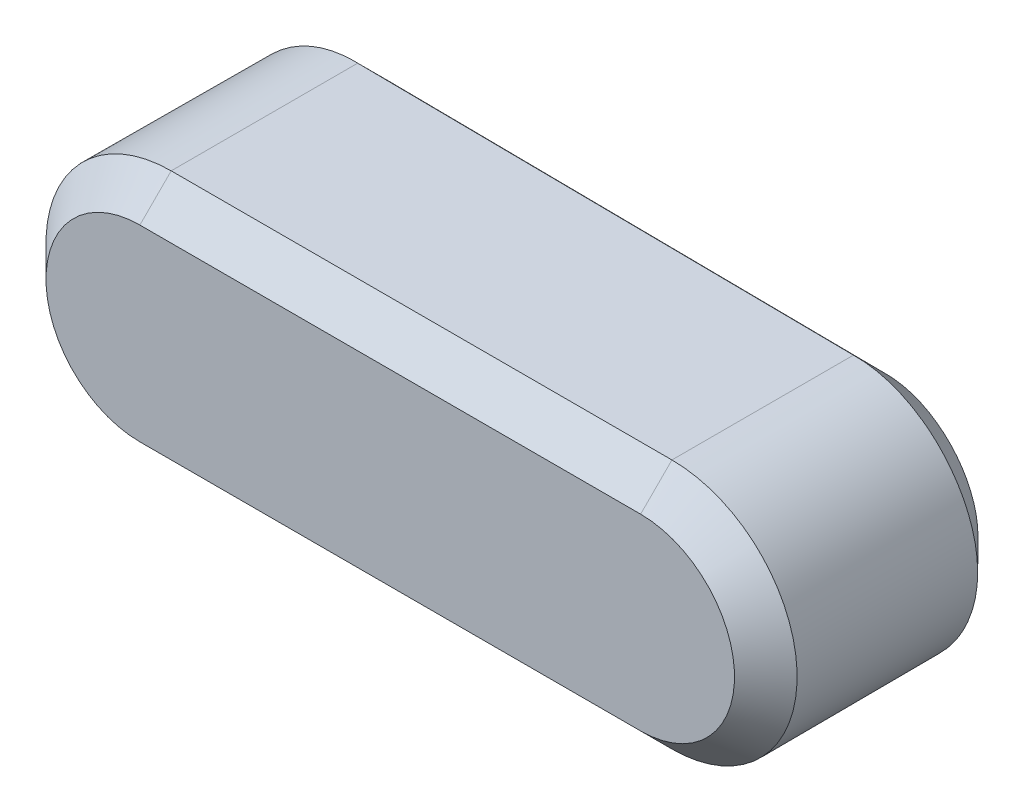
ISO-10303-21;
HEADER;
FILE_DESCRIPTION(('STEP AP214'),'2;1');
FILE_NAME('part.step','',(''),(''),'','','');
FILE_SCHEMA(('AUTOMOTIVE_DESIGN { 1 0 10303 214 1 1 1 1 }'));
ENDSEC;
DATA;
#1=APPLICATION_CONTEXT('core data for automotive mechanical design processes');
#2=APPLICATION_PROTOCOL_DEFINITION('international standard','automotive_design',2000,#1);
#3=PRODUCT_CONTEXT('',#1,'mechanical');
#4=PRODUCT('Part','Part','',(#3));
#5=PRODUCT_RELATED_PRODUCT_CATEGORY('part','',(#4));
#6=PRODUCT_DEFINITION_FORMATION('','',#4);
#7=PRODUCT_DEFINITION_CONTEXT('part definition',#1,'design');
#8=PRODUCT_DEFINITION('design','',#6,#7);
#9=PRODUCT_DEFINITION_SHAPE('','',#8);
#10=(LENGTH_UNIT() NAMED_UNIT(*) SI_UNIT(.MILLI.,.METRE.));
#11=(NAMED_UNIT(*) PLANE_ANGLE_UNIT() SI_UNIT($,.RADIAN.));
#12=(NAMED_UNIT(*) SI_UNIT($,.STERADIAN.) SOLID_ANGLE_UNIT());
#13=UNCERTAINTY_MEASURE_WITH_UNIT(LENGTH_MEASURE(1.E-05),#10,'distance_accuracy_value','');
#14=(GEOMETRIC_REPRESENTATION_CONTEXT(3) GLOBAL_UNCERTAINTY_ASSIGNED_CONTEXT((#13)) GLOBAL_UNIT_ASSIGNED_CONTEXT((#10,
#11,#12)) REPRESENTATION_CONTEXT('',''));
#15=CARTESIAN_POINT('',(0.,0.,0.));
#16=DIRECTION('',(0.,0.,1.));
#17=DIRECTION('',(1.,0.,0.));
#18=AXIS2_PLACEMENT_3D('',#15,#16,#17);
#19=CARTESIAN_POINT('',(-4.,0.,1.));
#20=DIRECTION('',(0.,0.,-1.));
#21=DIRECTION('',(-1.,0.,0.));
#22=AXIS2_PLACEMENT_3D('',#19,#20,#21);
#23=CYLINDRICAL_SURFACE('',#22,0.999999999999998);
#24=DIRECTION('',(0.,0.,-1.));
#25=VECTOR('',#24,1.);
#26=CARTESIAN_POINT('',(-4.,1.,1.));
#27=LINE('',#26,#25);
#28=CARTESIAN_POINT('',(-4.,1.,0.749999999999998));
#29=VERTEX_POINT('',#28);
#30=CARTESIAN_POINT('',(-4.,1.,-0.739987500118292));
#31=VERTEX_POINT('',#30);
#32=EDGE_CURVE('E146',#29,#31,#27,.T.);
#33=ORIENTED_EDGE('',*,*,#32,.T.);
#34=CARTESIAN_POINT('',(-4.,-0.999999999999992,-0.739987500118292));
#35=CARTESIAN_POINT('',(-4.53434581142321,-1.01380328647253,-0.743995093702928));
#36=CARTESIAN_POINT('',(-5.,-0.534524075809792,-0.74748750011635));
#37=CARTESIAN_POINT('',(-5.,0.5345240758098,-0.747487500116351));
#38=CARTESIAN_POINT('',(-4.53434581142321,1.01380328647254,-0.743995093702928));
#39=CARTESIAN_POINT('',(-4.,1.,-0.739987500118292));
#40=B_SPLINE_CURVE_WITH_KNOTS('',3,(#34,#35,#36,#37,#38,#39),.UNSPECIFIED.,.F.,.F.,(4,2,4),
(4.71238898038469,6.28318530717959,7.85398163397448),.UNSPECIFIED.);
#41=CARTESIAN_POINT('',(-4.,-0.999999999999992,-0.739987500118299));
#42=VERTEX_POINT('',#41);
#43=EDGE_CURVE('E114',#31,#42,#40,.F.);
#44=ORIENTED_EDGE('',*,*,#43,.T.);
#45=DIRECTION('',(0.,0.,-1.));
#46=VECTOR('',#45,1.);
#47=CARTESIAN_POINT('',(-4.,-0.999999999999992,1.));
#48=LINE('',#47,#46);
#49=CARTESIAN_POINT('',(-4.,-0.999999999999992,0.749999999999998));
#50=VERTEX_POINT('',#49);
#51=EDGE_CURVE('E122',#50,#42,#48,.T.);
#52=ORIENTED_EDGE('',*,*,#51,.F.);
#53=CARTESIAN_POINT('',(-4.,0.,0.749999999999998));
#54=DIRECTION('',(0.,0.,-1.));
#55=DIRECTION('',(-1.,0.,0.));
#56=AXIS2_PLACEMENT_3D('',#53,#54,#55);
#57=CIRCLE('',#56,0.999999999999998);
#58=EDGE_CURVE('E107',#50,#29,#57,.T.);
#59=ORIENTED_EDGE('',*,*,#58,.T.);
#60=EDGE_LOOP('',(#33,#44,#52,#59));
#61=FACE_BOUND('',#60,.T.);
#62=ADVANCED_FACE('F32',(#61),#23,.T.);
#63=CARTESIAN_POINT('',(0.,-0.999999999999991,1.));
#64=DIRECTION('',(0.,1.,0.));
#65=DIRECTION('',(-1.,0.,0.));
#66=AXIS2_PLACEMENT_3D('',#63,#64,#65);
#67=PLANE('',#66);
#68=ORIENTED_EDGE('',*,*,#51,.T.);
#69=DIRECTION('',(0.999950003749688,0.,0.00999950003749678));
#70=VECTOR('',#69,1.);
#71=CARTESIAN_POINT('',(0.0169981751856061,-0.999999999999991,-0.699817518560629));
#72=LINE('',#71,#70);
#73=CARTESIAN_POINT('',(0.,-0.999999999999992,-0.699987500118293));
#74=VERTEX_POINT('',#73);
#75=EDGE_CURVE('E126',#42,#74,#72,.T.);
#76=ORIENTED_EDGE('',*,*,#75,.T.);
#77=DIRECTION('',(0.,0.,-1.));
#78=VECTOR('',#77,1.);
#79=CARTESIAN_POINT('',(0.,-0.999999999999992,1.));
#80=LINE('',#79,#78);
#81=CARTESIAN_POINT('',(0.,-0.999999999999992,0.749999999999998));
#82=VERTEX_POINT('',#81);
#83=EDGE_CURVE('E125',#82,#74,#80,.T.);
#84=ORIENTED_EDGE('',*,*,#83,.F.);
#85=DIRECTION('',(-1.,0.,0.));
#86=VECTOR('',#85,1.);
#87=CARTESIAN_POINT('',(0.,-0.999999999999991,0.749999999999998));
#88=LINE('',#87,#86);
#89=EDGE_CURVE('E102',#82,#50,#88,.T.);
#90=ORIENTED_EDGE('',*,*,#89,.T.);
#91=EDGE_LOOP('',(#68,#76,#84,#90));
#92=FACE_BOUND('',#91,.T.);
#93=ADVANCED_FACE('F120',(#92),#67,.F.);
#94=CARTESIAN_POINT('',(0.,0.,1.));
#95=DIRECTION('',(0.,0.,-1.));
#96=DIRECTION('',(-1.,0.,0.));
#97=AXIS2_PLACEMENT_3D('',#94,#95,#96);
#98=CYLINDRICAL_SURFACE('',#97,0.999999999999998);
#99=ORIENTED_EDGE('',*,*,#83,.T.);
#100=CARTESIAN_POINT('',(0.,1.,-0.699987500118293));
#101=CARTESIAN_POINT('',(0.534345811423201,1.01380328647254,-0.695979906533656));
#102=CARTESIAN_POINT('',(0.999999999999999,0.534524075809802,-0.692487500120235));
#103=CARTESIAN_POINT('',(0.999999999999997,-0.534524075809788,-0.692487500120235));
#104=CARTESIAN_POINT('',(0.534345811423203,-1.01380328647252,-0.695979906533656));
#105=CARTESIAN_POINT('',(0.,-0.999999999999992,-0.699987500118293));
#106=B_SPLINE_CURVE_WITH_KNOTS('',3,(#100,#101,#102,#103,#104,#105),.UNSPECIFIED.,.F.,.F.,(4,2,
4),(1.5707963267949,3.14159265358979,4.71238898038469),.UNSPECIFIED.);
#107=CARTESIAN_POINT('',(0.,1.,-0.699987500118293));
#108=VERTEX_POINT('',#107);
#109=EDGE_CURVE('E152',#74,#108,#106,.F.);
#110=ORIENTED_EDGE('',*,*,#109,.T.);
#111=DIRECTION('',(0.,0.,-1.));
#112=VECTOR('',#111,1.);
#113=CARTESIAN_POINT('',(0.,1.,1.));
#114=LINE('',#113,#112);
#115=CARTESIAN_POINT('',(0.,1.,0.749999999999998));
#116=VERTEX_POINT('',#115);
#117=EDGE_CURVE('E131',#116,#108,#114,.T.);
#118=ORIENTED_EDGE('',*,*,#117,.F.);
#119=CARTESIAN_POINT('',(0.,0.,0.749999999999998));
#120=DIRECTION('',(0.,0.,-1.));
#121=DIRECTION('',(-1.,0.,0.));
#122=AXIS2_PLACEMENT_3D('',#119,#120,#121);
#123=CIRCLE('',#122,0.999999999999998);
#124=EDGE_CURVE('E150',#116,#82,#123,.T.);
#125=ORIENTED_EDGE('',*,*,#124,.T.);
#126=EDGE_LOOP('',(#99,#110,#118,#125));
#127=FACE_BOUND('',#126,.T.);
#128=ADVANCED_FACE('F163',(#127),#98,.T.);
#129=CARTESIAN_POINT('',(-4.,1.,1.));
#130=DIRECTION('',(0.,-1.,0.));
#131=DIRECTION('',(0.,0.,-1.));
#132=AXIS2_PLACEMENT_3D('',#129,#130,#131);
#133=PLANE('',#132);
#134=ORIENTED_EDGE('',*,*,#117,.T.);
#135=DIRECTION('',(-0.999950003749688,0.,-0.00999950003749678));
#136=VECTOR('',#135,1.);
#137=CARTESIAN_POINT('',(-3.98260186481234,1.,-0.739813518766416));
#138=LINE('',#137,#136);
#139=EDGE_CURVE('E336',#108,#31,#138,.T.);
#140=ORIENTED_EDGE('',*,*,#139,.T.);
#141=ORIENTED_EDGE('',*,*,#32,.F.);
#142=DIRECTION('',(1.,0.,0.));
#143=VECTOR('',#142,1.);
#144=CARTESIAN_POINT('',(-4.,1.,0.749999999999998));
#145=LINE('',#144,#143);
#146=EDGE_CURVE('E161',#29,#116,#145,.T.);
#147=ORIENTED_EDGE('',*,*,#146,.T.);
#148=EDGE_LOOP('',(#134,#140,#141,#147));
#149=FACE_BOUND('',#148,.T.);
#150=ADVANCED_FACE('F173',(#149),#133,.F.);
#151=CARTESIAN_POINT('',(-4.,0.,1.));
#152=DIRECTION('',(0.,0.,-1.));
#153=DIRECTION('',(-1.,0.,0.));
#154=AXIS2_PLACEMENT_3D('',#151,#152,#153);
#155=PLANE('',#154);
#156=CARTESIAN_POINT('',(-4.,0.,1.));
#157=DIRECTION('',(0.,0.,-1.));
#158=DIRECTION('',(-1.,0.,0.));
#159=AXIS2_PLACEMENT_3D('',#156,#157,#158);
#160=CIRCLE('',#159,0.749999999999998);
#161=CARTESIAN_POINT('',(-4.,0.750000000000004,1.));
#162=VERTEX_POINT('',#161);
#163=CARTESIAN_POINT('',(-4.,-0.749999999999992,1.));
#164=VERTEX_POINT('',#163);
#165=EDGE_CURVE('E56',#162,#164,#160,.F.);
#166=ORIENTED_EDGE('',*,*,#165,.T.);
#167=DIRECTION('',(1.,0.,0.));
#168=VECTOR('',#167,1.);
#169=CARTESIAN_POINT('',(-4.,-0.749999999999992,1.));
#170=LINE('',#169,#168);
#171=CARTESIAN_POINT('',(0.,-0.749999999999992,1.));
#172=VERTEX_POINT('',#171);
#173=EDGE_CURVE('E11',#164,#172,#170,.T.);
#174=ORIENTED_EDGE('',*,*,#173,.T.);
#175=CARTESIAN_POINT('',(0.,0.,1.));
#176=DIRECTION('',(0.,0.,-1.));
#177=DIRECTION('',(-1.,0.,0.));
#178=AXIS2_PLACEMENT_3D('',#175,#176,#177);
#179=CIRCLE('',#178,0.749999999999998);
#180=CARTESIAN_POINT('',(0.,0.750000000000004,1.));
#181=VERTEX_POINT('',#180);
#182=EDGE_CURVE('E41',#172,#181,#179,.F.);
#183=ORIENTED_EDGE('',*,*,#182,.T.);
#184=DIRECTION('',(-1.,0.,0.));
#185=VECTOR('',#184,1.);
#186=CARTESIAN_POINT('',(-4.,0.750000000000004,1.));
#187=LINE('',#186,#185);
#188=EDGE_CURVE('E339',#181,#162,#187,.T.);
#189=ORIENTED_EDGE('',*,*,#188,.T.);
#190=EDGE_LOOP('',(#166,#174,#183,#189));
#191=FACE_BOUND('',#190,.T.);
#192=ADVANCED_FACE('F308',(#191),#155,.F.);
#193=CARTESIAN_POINT('',(0.999999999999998,-0.999999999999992,-0.940000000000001));
#194=DIRECTION('',(-0.00999950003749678,0.,0.999950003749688));
#195=DIRECTION('',(0.999950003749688,0.,0.00999950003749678));
#196=AXIS2_PLACEMENT_3D('',#193,#194,#195);
#197=PLANE('',#196);
#198=CARTESIAN_POINT('',(0.00249987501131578,-0.74999999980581,-0.949975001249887));
#199=CARTESIAN_POINT('',(0.403259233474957,-0.760352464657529,-0.945967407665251));
#200=CARTESIAN_POINT('',(0.752499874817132,-0.400893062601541,-0.942475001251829));
#201=CARTESIAN_POINT('',(0.752499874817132,0.400893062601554,-0.942475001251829));
#202=CARTESIAN_POINT('',(0.403259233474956,0.760352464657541,-0.945967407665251));
#203=CARTESIAN_POINT('',(0.002499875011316,0.749999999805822,-0.949975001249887));
#204=B_SPLINE_CURVE_WITH_KNOTS('',3,(#198,#199,#200,#201,#202,#203),.UNSPECIFIED.,.F.,.F.,(4,2,
4),(1.5707963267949,3.14159265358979,4.71238898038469),.UNSPECIFIED.);
#205=CARTESIAN_POINT('',(0.002499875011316,0.749999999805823,-0.949975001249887));
#206=VERTEX_POINT('',#205);
#207=CARTESIAN_POINT('',(0.00249987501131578,-0.74999999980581,-0.949975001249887));
#208=VERTEX_POINT('',#207);
#209=EDGE_CURVE('E323',#206,#208,#204,.F.);
#210=ORIENTED_EDGE('',*,*,#209,.T.);
#211=DIRECTION('',(-0.999950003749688,0.,-0.00999950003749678));
#212=VECTOR('',#211,1.);
#213=CARTESIAN_POINT('',(0.999999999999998,-0.749999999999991,-0.940000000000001));
#214=LINE('',#213,#212);
#215=CARTESIAN_POINT('',(-3.99750012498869,-0.749999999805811,-0.989975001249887));
#216=VERTEX_POINT('',#215);
#217=EDGE_CURVE('E115',#208,#216,#214,.T.);
#218=ORIENTED_EDGE('',*,*,#217,.T.);
#219=CARTESIAN_POINT('',(-3.99750012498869,0.749999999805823,-0.989975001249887));
#220=CARTESIAN_POINT('',(-4.39825948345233,0.760352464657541,-0.993982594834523));
#221=CARTESIAN_POINT('',(-4.74750012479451,0.400893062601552,-0.997475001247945));
#222=CARTESIAN_POINT('',(-4.7475001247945,-0.400893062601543,-0.997475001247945));
#223=CARTESIAN_POINT('',(-4.39825948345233,-0.760352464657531,-0.993982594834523));
#224=CARTESIAN_POINT('',(-3.99750012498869,-0.749999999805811,-0.989975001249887));
#225=B_SPLINE_CURVE_WITH_KNOTS('',3,(#219,#220,#221,#222,#223,#224),.UNSPECIFIED.,.F.,.F.,(4,2,
4),(4.71238898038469,6.28318530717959,7.85398163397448),.UNSPECIFIED.);
#226=CARTESIAN_POINT('',(-3.99750012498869,0.749999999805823,-0.989975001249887));
#227=VERTEX_POINT('',#226);
#228=EDGE_CURVE('E268',#216,#227,#225,.F.);
#229=ORIENTED_EDGE('',*,*,#228,.T.);
#230=DIRECTION('',(0.999950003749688,0.,0.00999950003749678));
#231=VECTOR('',#230,1.);
#232=CARTESIAN_POINT('',(0.999999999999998,0.749999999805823,-0.940000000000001));
#233=LINE('',#232,#231);
#234=EDGE_CURVE('E317',#227,#206,#233,.T.);
#235=ORIENTED_EDGE('',*,*,#234,.T.);
#236=EDGE_LOOP('',(#210,#218,#229,#235));
#237=FACE_BOUND('',#236,.T.);
#238=ADVANCED_FACE('F300',(#237),#197,.F.);
#239=CARTESIAN_POINT('',(0.999999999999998,0.749999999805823,-0.940000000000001));
#240=DIRECTION('',(-0.0070707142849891,-0.707106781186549,0.707071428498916));
#241=DIRECTION('',(0.,-0.707089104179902,-0.707124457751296));
#242=AXIS2_PLACEMENT_3D('',#239,#240,#241);
#243=PLANE('',#242);
#244=CARTESIAN_POINT('',(0.002499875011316,0.749999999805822,-0.949975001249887));
#245=CARTESIAN_POINT('',(0.,1.,-0.699987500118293));
#246=B_SPLINE_CURVE_WITH_KNOTS('',1,(#244,#245),.UNSPECIFIED.,.F.,.F.,(2,2),(0.,1.),.UNSPECIFIED.);
#247=EDGE_CURVE('E285',#206,#108,#246,.T.);
#248=ORIENTED_EDGE('',*,*,#247,.F.);
#249=ORIENTED_EDGE('',*,*,#234,.F.);
#250=CARTESIAN_POINT('',(-4.,1.,-0.739987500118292));
#251=CARTESIAN_POINT('',(-3.99750012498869,0.749999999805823,-0.989975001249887));
#252=B_SPLINE_CURVE_WITH_KNOTS('',1,(#250,#251),.UNSPECIFIED.,.F.,.F.,(2,2),(0.,1.),.UNSPECIFIED.);
#253=EDGE_CURVE('E259',#31,#227,#252,.T.);
#254=ORIENTED_EDGE('',*,*,#253,.F.);
#255=ORIENTED_EDGE('',*,*,#139,.F.);
#256=EDGE_LOOP('',(#248,#249,#254,#255));
#257=FACE_BOUND('',#256,.T.);
#258=ADVANCED_FACE('F227',(#257),#243,.F.);
#259=CARTESIAN_POINT('',(-4.,1.,-0.739987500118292));
#260=CARTESIAN_POINT('',(-4.53434581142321,1.01380328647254,-0.743995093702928));
#261=CARTESIAN_POINT('',(-5.,0.5345240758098,-0.747487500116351));
#262=CARTESIAN_POINT('',(-5.,-0.534524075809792,-0.74748750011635));
#263=CARTESIAN_POINT('',(-4.53434581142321,-1.01380328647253,-0.743995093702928));
#264=CARTESIAN_POINT('',(-4.,-0.999999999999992,-0.739987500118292));
#265=CARTESIAN_POINT('',(-3.99750012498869,0.749999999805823,-0.989975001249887));
#266=CARTESIAN_POINT('',(-4.39825948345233,0.760352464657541,-0.993982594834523));
#267=CARTESIAN_POINT('',(-4.74750012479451,0.400893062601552,-0.997475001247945));
#268=CARTESIAN_POINT('',(-4.7475001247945,-0.400893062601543,-0.997475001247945));
#269=CARTESIAN_POINT('',(-4.39825948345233,-0.760352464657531,-0.993982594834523));
#270=CARTESIAN_POINT('',(-3.99750012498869,-0.749999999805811,-0.989975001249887));
#271=B_SPLINE_SURFACE_WITH_KNOTS('',1,3,((#259,#260,#261,#262,#263,#264),(#265,#266,#267,#268,
#269,#270)),.UNSPECIFIED.,.F.,.F.,.F.,(2,2),(4,2,4),(0.,1.),(4.71238898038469,6.28318530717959,
7.85398163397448),.UNSPECIFIED.);
#272=CARTESIAN_POINT('',(-3.99750012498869,-0.749999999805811,-0.989975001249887));
#273=CARTESIAN_POINT('',(-4.,-0.999999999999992,-0.739987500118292));
#274=B_SPLINE_CURVE_WITH_KNOTS('',1,(#272,#273),.UNSPECIFIED.,.F.,.F.,(2,2),(0.,1.),.UNSPECIFIED.);
#275=EDGE_CURVE('E209',#42,#216,#274,.F.);
#276=ORIENTED_EDGE('',*,*,#253,.T.);
#277=ORIENTED_EDGE('',*,*,#228,.F.);
#278=ORIENTED_EDGE('',*,*,#275,.F.);
#279=ORIENTED_EDGE('',*,*,#43,.F.);
#280=EDGE_LOOP('',(#276,#277,#278,#279));
#281=FACE_BOUND('',#280,.T.);
#282=ADVANCED_FACE('F216',(#281),#271,.T.);
#283=CARTESIAN_POINT('',(0.,-0.999999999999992,-0.699987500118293));
#284=CARTESIAN_POINT('',(0.534345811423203,-1.01380328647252,-0.695979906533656));
#285=CARTESIAN_POINT('',(0.999999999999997,-0.534524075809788,-0.692487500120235));
#286=CARTESIAN_POINT('',(0.999999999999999,0.534524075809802,-0.692487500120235));
#287=CARTESIAN_POINT('',(0.534345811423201,1.01380328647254,-0.695979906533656));
#288=CARTESIAN_POINT('',(0.,1.,-0.699987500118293));
#289=CARTESIAN_POINT('',(0.00249987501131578,-0.74999999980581,-0.949975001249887));
#290=CARTESIAN_POINT('',(0.403259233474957,-0.760352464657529,-0.945967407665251));
#291=CARTESIAN_POINT('',(0.752499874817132,-0.400893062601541,-0.942475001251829));
#292=CARTESIAN_POINT('',(0.752499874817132,0.400893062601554,-0.942475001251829));
#293=CARTESIAN_POINT('',(0.403259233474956,0.760352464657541,-0.945967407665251));
#294=CARTESIAN_POINT('',(0.002499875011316,0.749999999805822,-0.949975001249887));
#295=B_SPLINE_SURFACE_WITH_KNOTS('',1,3,((#283,#284,#285,#286,#287,#288),(#289,#290,#291,#292,
#293,#294)),.UNSPECIFIED.,.F.,.F.,.F.,(2,2),(4,2,4),(0.,1.),(1.5707963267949,3.14159265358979,
4.71238898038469),.UNSPECIFIED.);
#296=CARTESIAN_POINT('',(0.,-0.999999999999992,-0.699987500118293));
#297=CARTESIAN_POINT('',(0.00249987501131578,-0.74999999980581,-0.949975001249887));
#298=B_SPLINE_CURVE_WITH_KNOTS('',1,(#296,#297),.UNSPECIFIED.,.F.,.F.,(2,2),(0.,1.),.UNSPECIFIED.);
#299=EDGE_CURVE('E282',#208,#74,#298,.F.);
#300=ORIENTED_EDGE('',*,*,#247,.T.);
#301=ORIENTED_EDGE('',*,*,#109,.F.);
#302=ORIENTED_EDGE('',*,*,#299,.F.);
#303=ORIENTED_EDGE('',*,*,#209,.F.);
#304=EDGE_LOOP('',(#300,#301,#302,#303));
#305=FACE_BOUND('',#304,.T.);
#306=ADVANCED_FACE('F183',(#305),#295,.T.);
#307=CARTESIAN_POINT('',(0.0169981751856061,-0.999999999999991,-0.699817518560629));
#308=DIRECTION('',(-0.00707071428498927,0.707106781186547,0.707071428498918));
#309=DIRECTION('',(0.,-0.707089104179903,0.707124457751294));
#310=AXIS2_PLACEMENT_3D('',#307,#308,#309);
#311=PLANE('',#310);
#312=ORIENTED_EDGE('',*,*,#275,.T.);
#313=ORIENTED_EDGE('',*,*,#217,.F.);
#314=ORIENTED_EDGE('',*,*,#299,.T.);
#315=ORIENTED_EDGE('',*,*,#75,.F.);
#316=EDGE_LOOP('',(#312,#313,#314,#315));
#317=FACE_BOUND('',#316,.T.);
#318=ADVANCED_FACE('F179',(#317),#311,.F.);
#319=CARTESIAN_POINT('',(-4.,0.750000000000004,1.));
#320=DIRECTION('',(0.,-0.70710678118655,-0.707106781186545));
#321=DIRECTION('',(0.,0.707106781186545,-0.70710678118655));
#322=AXIS2_PLACEMENT_3D('',#319,#320,#321);
#323=PLANE('',#322);
#324=DIRECTION('',(0.,-0.707106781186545,0.70710678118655));
#325=VECTOR('',#324,1.);
#326=CARTESIAN_POINT('',(0.,1.,0.749999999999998));
#327=LINE('',#326,#325);
#328=EDGE_CURVE('E104',#116,#181,#327,.T.);
#329=ORIENTED_EDGE('',*,*,#328,.F.);
#330=ORIENTED_EDGE('',*,*,#146,.F.);
#331=DIRECTION('',(0.,0.707106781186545,-0.70710678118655));
#332=VECTOR('',#331,1.);
#333=CARTESIAN_POINT('',(-4.,0.750000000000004,1.));
#334=LINE('',#333,#332);
#335=EDGE_CURVE('E36',#162,#29,#334,.T.);
#336=ORIENTED_EDGE('',*,*,#335,.F.);
#337=ORIENTED_EDGE('',*,*,#188,.F.);
#338=EDGE_LOOP('',(#329,#330,#336,#337));
#339=FACE_BOUND('',#338,.T.);
#340=ADVANCED_FACE('F34',(#339),#323,.F.);
#341=CARTESIAN_POINT('',(-4.,0.,1.));
#342=DIRECTION('',(0.,0.,-1.));
#343=DIRECTION('',(-1.,0.,0.));
#344=AXIS2_PLACEMENT_3D('',#341,#342,#343);
#345=CONICAL_SURFACE('',#344,0.749999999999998,0.785398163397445);
#346=ORIENTED_EDGE('',*,*,#335,.T.);
#347=ORIENTED_EDGE('',*,*,#58,.F.);
#348=DIRECTION('',(0.,-0.707106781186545,-0.70710678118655));
#349=VECTOR('',#348,1.);
#350=CARTESIAN_POINT('',(-4.,-0.749999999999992,1.));
#351=LINE('',#350,#349);
#352=EDGE_CURVE('E98',#164,#50,#351,.T.);
#353=ORIENTED_EDGE('',*,*,#352,.F.);
#354=ORIENTED_EDGE('',*,*,#165,.F.);
#355=EDGE_LOOP('',(#346,#347,#353,#354));
#356=FACE_BOUND('',#355,.T.);
#357=ADVANCED_FACE('F108',(#356),#345,.T.);
#358=CARTESIAN_POINT('',(0.,0.,1.));
#359=DIRECTION('',(0.,0.,-1.));
#360=DIRECTION('',(-1.,0.,0.));
#361=AXIS2_PLACEMENT_3D('',#358,#359,#360);
#362=CONICAL_SURFACE('',#361,0.749999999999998,0.785398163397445);
#363=ORIENTED_EDGE('',*,*,#328,.T.);
#364=ORIENTED_EDGE('',*,*,#182,.F.);
#365=DIRECTION('',(0.,0.707106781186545,0.70710678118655));
#366=VECTOR('',#365,1.);
#367=CARTESIAN_POINT('',(0.,-0.999999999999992,0.749999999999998));
#368=LINE('',#367,#366);
#369=EDGE_CURVE('E49',#82,#172,#368,.T.);
#370=ORIENTED_EDGE('',*,*,#369,.F.);
#371=ORIENTED_EDGE('',*,*,#124,.F.);
#372=EDGE_LOOP('',(#363,#364,#370,#371));
#373=FACE_BOUND('',#372,.T.);
#374=ADVANCED_FACE('F326',(#373),#362,.T.);
#375=CARTESIAN_POINT('',(-4.,-0.749999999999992,1.));
#376=DIRECTION('',(0.,0.70710678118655,-0.707106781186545));
#377=DIRECTION('',(0.,0.707106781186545,0.70710678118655));
#378=AXIS2_PLACEMENT_3D('',#375,#376,#377);
#379=PLANE('',#378);
#380=ORIENTED_EDGE('',*,*,#352,.T.);
#381=ORIENTED_EDGE('',*,*,#89,.F.);
#382=ORIENTED_EDGE('',*,*,#369,.T.);
#383=ORIENTED_EDGE('',*,*,#173,.F.);
#384=EDGE_LOOP('',(#380,#381,#382,#383));
#385=FACE_BOUND('',#384,.T.);
#386=ADVANCED_FACE('F100',(#385),#379,.F.);
#387=CLOSED_SHELL('',(#62,#93,#128,#150,#192,#238,#258,#282,#306,#318,#340,#357,#374,#386));
#388=MANIFOLD_SOLID_BREP('B2',#387);
#389=ADVANCED_BREP_SHAPE_REPRESENTATION('',(#18,#388),#14);
#390=SHAPE_DEFINITION_REPRESENTATION(#9,#389);
ENDSEC;
END-ISO-10303-21;
